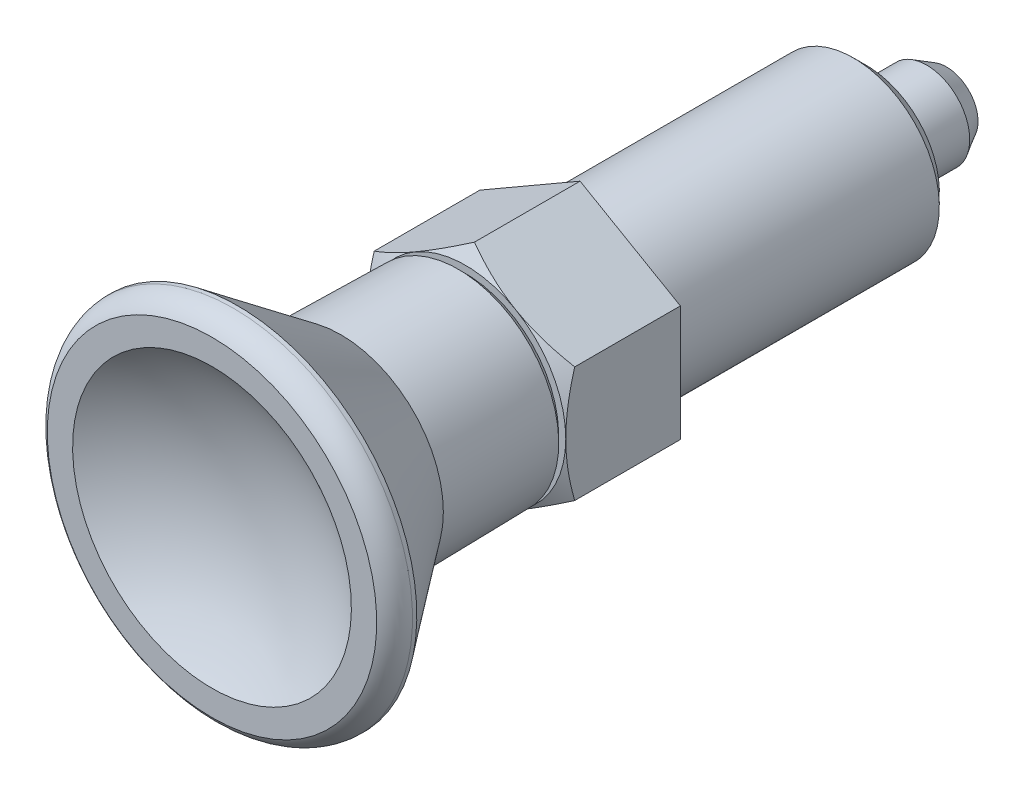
ISO-10303-21;
HEADER;
FILE_DESCRIPTION(('STEP AP214'),'2;1');
FILE_NAME('part.step','',(''),(''),'','','');
FILE_SCHEMA(('AUTOMOTIVE_DESIGN { 1 0 10303 214 1 1 1 1 }'));
ENDSEC;
DATA;
#1=APPLICATION_CONTEXT('core data for automotive mechanical design processes');
#2=APPLICATION_PROTOCOL_DEFINITION('international standard','automotive_design',2000,#1);
#3=PRODUCT_CONTEXT('',#1,'mechanical');
#4=PRODUCT('Part','Part','',(#3));
#5=PRODUCT_RELATED_PRODUCT_CATEGORY('part','',(#4));
#6=PRODUCT_DEFINITION_FORMATION('','',#4);
#7=PRODUCT_DEFINITION_CONTEXT('part definition',#1,'design');
#8=PRODUCT_DEFINITION('design','',#6,#7);
#9=PRODUCT_DEFINITION_SHAPE('','',#8);
#10=(LENGTH_UNIT() NAMED_UNIT(*) SI_UNIT(.MILLI.,.METRE.));
#11=(NAMED_UNIT(*) PLANE_ANGLE_UNIT() SI_UNIT($,.RADIAN.));
#12=(NAMED_UNIT(*) SI_UNIT($,.STERADIAN.) SOLID_ANGLE_UNIT());
#13=UNCERTAINTY_MEASURE_WITH_UNIT(LENGTH_MEASURE(1.E-05),#10,'distance_accuracy_value','');
#14=(GEOMETRIC_REPRESENTATION_CONTEXT(3) GLOBAL_UNCERTAINTY_ASSIGNED_CONTEXT((#13)) GLOBAL_UNIT_ASSIGNED_CONTEXT((#10,
#11,#12)) REPRESENTATION_CONTEXT('',''));
#15=CARTESIAN_POINT('',(0.,0.,0.));
#16=DIRECTION('',(0.,0.,1.));
#17=DIRECTION('',(1.,0.,0.));
#18=AXIS2_PLACEMENT_3D('',#15,#16,#17);
#19=CARTESIAN_POINT('',(0.,0.,-20.));
#20=DIRECTION('',(-1.,0.,0.));
#21=DIRECTION('',(0.,1.,0.));
#22=AXIS2_PLACEMENT_3D('',#19,#20,#21);
#23=SPHERICAL_SURFACE('',#22,6.00000000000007);
#24=CARTESIAN_POINT('',(0.,0.,-25.5810746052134));
#25=DIRECTION('',(0.,0.,1.));
#26=DIRECTION('',(-1.,0.,0.));
#27=AXIS2_PLACEMENT_3D('',#24,#25,#26);
#28=CIRCLE('',#27,2.20263620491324);
#29=CARTESIAN_POINT('',(-2.20263620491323,0.,-25.5810746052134));
#30=VERTEX_POINT('',#29);
#31=EDGE_CURVE('E18',#30,#30,#28,.T.);
#32=ORIENTED_EDGE('',*,*,#31,.F.);
#33=EDGE_LOOP('',(#32));
#34=FACE_BOUND('',#33,.T.);
#35=ADVANCED_FACE('F14',(#34),#23,.T.);
#36=CARTESIAN_POINT('',(0.,0.,-24.2000000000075));
#37=DIRECTION('',(0.,0.,1.));
#38=DIRECTION('',(-1.,0.,0.));
#39=AXIS2_PLACEMENT_3D('',#36,#37,#38);
#40=CONICAL_SURFACE('',#39,2.99999999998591,0.523598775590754);
#41=CARTESIAN_POINT('',(0.,0.,-24.2));
#42=DIRECTION('',(0.,0.,1.));
#43=DIRECTION('',(0.,-1.,0.));
#44=AXIS2_PLACEMENT_3D('',#41,#42,#43);
#45=CIRCLE('',#44,3.);
#46=CARTESIAN_POINT('',(0.,-3.,-24.2));
#47=VERTEX_POINT('',#46);
#48=EDGE_CURVE('E190',#47,#47,#45,.T.);
#49=ORIENTED_EDGE('',*,*,#48,.F.);
#50=EDGE_LOOP('',(#49));
#51=FACE_BOUND('',#50,.T.);
#52=ORIENTED_EDGE('',*,*,#31,.T.);
#53=EDGE_LOOP('',(#52));
#54=FACE_BOUND('',#53,.T.);
#55=ADVANCED_FACE('F297',(#51,#54),#40,.T.);
#56=CARTESIAN_POINT('',(0.,0.,-26.));
#57=DIRECTION('',(0.,0.,1.));
#58=DIRECTION('',(0.,-1.,0.));
#59=AXIS2_PLACEMENT_3D('',#56,#57,#58);
#60=CYLINDRICAL_SURFACE('',#59,3.);
#61=CARTESIAN_POINT('',(0.,0.,-20.5000000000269));
#62=DIRECTION('',(0.,0.,-1.));
#63=DIRECTION('',(0.,1.,0.));
#64=AXIS2_PLACEMENT_3D('',#61,#62,#63);
#65=CIRCLE('',#64,3.00000000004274);
#66=CARTESIAN_POINT('',(0.,3.00000000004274,-20.5000000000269));
#67=VERTEX_POINT('',#66);
#68=EDGE_CURVE('E185',#67,#67,#65,.F.);
#69=ORIENTED_EDGE('',*,*,#68,.F.);
#70=EDGE_LOOP('',(#69));
#71=FACE_BOUND('',#70,.T.);
#72=ORIENTED_EDGE('',*,*,#48,.T.);
#73=EDGE_LOOP('',(#72));
#74=FACE_BOUND('',#73,.T.);
#75=ADVANCED_FACE('F292',(#71,#74),#60,.T.);
#76=CARTESIAN_POINT('',(0.,0.,-20.5000000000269));
#77=DIRECTION('',(0.,0.,-1.));
#78=DIRECTION('',(0.,1.,0.));
#79=AXIS2_PLACEMENT_3D('',#76,#77,#78);
#80=CONICAL_SURFACE('',#79,3.00000000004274,0.523598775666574);
#81=CARTESIAN_POINT('',(0.,0.,-20.3267949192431));
#82=DIRECTION('',(0.,0.,1.));
#83=DIRECTION('',(0.,-1.,0.));
#84=AXIS2_PLACEMENT_3D('',#81,#82,#83);
#85=CIRCLE('',#84,2.9);
#86=CARTESIAN_POINT('',(0.,-2.9,-20.3267949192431));
#87=VERTEX_POINT('',#86);
#88=EDGE_CURVE('E176',#87,#87,#85,.T.);
#89=ORIENTED_EDGE('',*,*,#88,.F.);
#90=EDGE_LOOP('',(#89));
#91=FACE_BOUND('',#90,.T.);
#92=ORIENTED_EDGE('',*,*,#68,.T.);
#93=EDGE_LOOP('',(#92));
#94=FACE_BOUND('',#93,.T.);
#95=ADVANCED_FACE('F287',(#91,#94),#80,.T.);
#96=CARTESIAN_POINT('',(0.,0.,-26.));
#97=DIRECTION('',(0.,0.,1.));
#98=DIRECTION('',(0.,-1.,0.));
#99=AXIS2_PLACEMENT_3D('',#96,#97,#98);
#100=CYLINDRICAL_SURFACE('',#99,2.9);
#101=CARTESIAN_POINT('',(0.,0.,-20.2));
#102=DIRECTION('',(0.,0.,-1.));
#103=DIRECTION('',(0.,1.,0.));
#104=AXIS2_PLACEMENT_3D('',#101,#102,#103);
#105=CIRCLE('',#104,2.9);
#106=CARTESIAN_POINT('',(0.,2.9,-20.2));
#107=VERTEX_POINT('',#106);
#108=EDGE_CURVE('E184',#107,#107,#105,.T.);
#109=ORIENTED_EDGE('',*,*,#108,.T.);
#110=EDGE_LOOP('',(#109));
#111=FACE_BOUND('',#110,.T.);
#112=ORIENTED_EDGE('',*,*,#88,.T.);
#113=EDGE_LOOP('',(#112));
#114=FACE_BOUND('',#113,.T.);
#115=ADVANCED_FACE('F167',(#111,#114),#100,.T.);
#116=CARTESIAN_POINT('',(0.,0.,-20.2));
#117=DIRECTION('',(0.,0.,-1.));
#118=DIRECTION('',(0.,1.,0.));
#119=AXIS2_PLACEMENT_3D('',#116,#117,#118);
#120=TOROIDAL_SURFACE('',#119,3.1,0.2);
#121=CARTESIAN_POINT('',(0.,0.,-20.));
#122=DIRECTION('',(0.,0.,-1.));
#123=DIRECTION('',(0.,1.,0.));
#124=AXIS2_PLACEMENT_3D('',#121,#122,#123);
#125=CIRCLE('',#124,3.1);
#126=CARTESIAN_POINT('',(0.,3.1,-20.));
#127=VERTEX_POINT('',#126);
#128=EDGE_CURVE('E143',#127,#127,#125,.T.);
#129=ORIENTED_EDGE('',*,*,#128,.T.);
#130=EDGE_LOOP('',(#129));
#131=FACE_BOUND('',#130,.T.);
#132=ORIENTED_EDGE('',*,*,#108,.F.);
#133=EDGE_LOOP('',(#132));
#134=FACE_BOUND('',#133,.T.);
#135=ADVANCED_FACE('F161',(#131,#134),#120,.F.);
#136=CARTESIAN_POINT('',(4.07679491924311,0.,-20.));
#137=DIRECTION('',(0.,0.,1.));
#138=DIRECTION('',(0.,-1.,0.));
#139=AXIS2_PLACEMENT_3D('',#136,#137,#138);
#140=PLANE('',#139);
#141=CARTESIAN_POINT('',(0.,0.,-19.9999999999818));
#142=DIRECTION('',(0.,0.,1.));
#143=DIRECTION('',(0.,-1.,0.));
#144=AXIS2_PLACEMENT_3D('',#141,#142,#143);
#145=CIRCLE('',#144,4.07679491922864);
#146=CARTESIAN_POINT('',(0.,-4.07679491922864,-19.9999999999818));
#147=VERTEX_POINT('',#146);
#148=EDGE_CURVE('E136',#147,#147,#145,.T.);
#149=ORIENTED_EDGE('',*,*,#148,.F.);
#150=EDGE_LOOP('',(#149));
#151=FACE_BOUND('',#150,.T.);
#152=ORIENTED_EDGE('',*,*,#128,.F.);
#153=EDGE_LOOP('',(#152));
#154=FACE_BOUND('',#153,.T.);
#155=ADVANCED_FACE('F150',(#151,#154),#140,.F.);
#156=CARTESIAN_POINT('',(0.,0.,-19.6999999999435));
#157=DIRECTION('',(0.,0.,1.));
#158=DIRECTION('',(0.,-1.,0.));
#159=AXIS2_PLACEMENT_3D('',#156,#157,#158);
#160=CONICAL_SURFACE('',#159,4.25000000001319,0.52359877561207);
#161=CARTESIAN_POINT('',(0.,0.,-19.7));
#162=DIRECTION('',(0.,0.,1.));
#163=DIRECTION('',(0.,-1.,0.));
#164=AXIS2_PLACEMENT_3D('',#161,#162,#163);
#165=CIRCLE('',#164,4.25);
#166=CARTESIAN_POINT('',(0.,-4.25,-19.7));
#167=VERTEX_POINT('',#166);
#168=EDGE_CURVE('E132',#167,#167,#165,.F.);
#169=ORIENTED_EDGE('',*,*,#168,.T.);
#170=EDGE_LOOP('',(#169));
#171=FACE_BOUND('',#170,.T.);
#172=ORIENTED_EDGE('',*,*,#148,.T.);
#173=EDGE_LOOP('',(#172));
#174=FACE_BOUND('',#173,.T.);
#175=ADVANCED_FACE('F160',(#171,#174),#160,.T.);
#176=CARTESIAN_POINT('',(0.,0.,-20.));
#177=DIRECTION('',(0.,0.,1.));
#178=DIRECTION('',(0.,-1.,0.));
#179=AXIS2_PLACEMENT_3D('',#176,#177,#178);
#180=CYLINDRICAL_SURFACE('',#179,4.25);
#181=ORIENTED_EDGE('',*,*,#168,.F.);
#182=EDGE_LOOP('',(#181));
#183=FACE_BOUND('',#182,.T.);
#184=CARTESIAN_POINT('',(0.,0.,-20.));
#185=DIRECTION('',(0.,0.,1.));
#186=DIRECTION('',(0.,-1.,0.));
#187=AXIS2_PLACEMENT_3D('',#184,#185,#186);
#188=CIRCLE('',#187,4.25);
#189=CARTESIAN_POINT('',(0.,-4.25,-20.));
#190=VERTEX_POINT('',#189);
#191=EDGE_CURVE('E135',#190,#190,#188,.T.);
#192=ORIENTED_EDGE('',*,*,#191,.F.);
#193=EDGE_LOOP('',(#192));
#194=FACE_BOUND('',#193,.T.);
#195=ADVANCED_FACE('F255',(#183,#194),#180,.F.);
#196=CARTESIAN_POINT('',(4.25,0.,-20.));
#197=DIRECTION('',(0.,0.,-1.));
#198=DIRECTION('',(0.,1.,0.));
#199=AXIS2_PLACEMENT_3D('',#196,#197,#198);
#200=PLANE('',#199);
#201=ORIENTED_EDGE('',*,*,#191,.T.);
#202=EDGE_LOOP('',(#201));
#203=FACE_BOUND('',#202,.T.);
#204=CARTESIAN_POINT('',(0.,0.,-19.9999999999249));
#205=DIRECTION('',(0.,0.,1.));
#206=DIRECTION('',(0.,-1.,0.));
#207=AXIS2_PLACEMENT_3D('',#204,#205,#206);
#208=CIRCLE('',#207,5.08000000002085);
#209=CARTESIAN_POINT('',(0.,-5.08000000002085,-19.9999999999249));
#210=VERTEX_POINT('',#209);
#211=EDGE_CURVE('E129',#210,#210,#208,.T.);
#212=ORIENTED_EDGE('',*,*,#211,.F.);
#213=EDGE_LOOP('',(#212));
#214=FACE_BOUND('',#213,.T.);
#215=ADVANCED_FACE('F246',(#203,#214),#200,.T.);
#216=CARTESIAN_POINT('',(0.,0.,-19.0799999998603));
#217=DIRECTION('',(0.,0.,1.));
#218=DIRECTION('',(0.,-1.,0.));
#219=AXIS2_PLACEMENT_3D('',#216,#217,#218);
#220=CONICAL_SURFACE('',#219,6.00000000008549,0.785398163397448);
#221=ORIENTED_EDGE('',*,*,#211,.T.);
#222=EDGE_LOOP('',(#221));
#223=FACE_BOUND('',#222,.T.);
#224=CARTESIAN_POINT('',(0.,0.,-19.08));
#225=DIRECTION('',(0.,0.,1.));
#226=DIRECTION('',(0.,-1.,0.));
#227=AXIS2_PLACEMENT_3D('',#224,#225,#226);
#228=CIRCLE('',#227,6.);
#229=CARTESIAN_POINT('',(0.,-6.,-19.08));
#230=VERTEX_POINT('',#229);
#231=EDGE_CURVE('E126',#230,#230,#228,.T.);
#232=ORIENTED_EDGE('',*,*,#231,.F.);
#233=EDGE_LOOP('',(#232));
#234=FACE_BOUND('',#233,.T.);
#235=ADVANCED_FACE('F244',(#223,#234),#220,.T.);
#236=CARTESIAN_POINT('',(0.,0.,38.4));
#237=DIRECTION('',(-1.,0.,0.));
#238=DIRECTION('',(0.,1.,0.));
#239=AXIS2_PLACEMENT_3D('',#236,#237,#238);
#240=SPHERICAL_SURFACE('',#239,16.);
#241=CARTESIAN_POINT('',(0.,9.73190628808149,25.7));
#242=CARTESIAN_POINT('',(-0.273421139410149,9.73190824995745,25.7));
#243=CARTESIAN_POINT('',(-0.54681008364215,9.72037876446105,25.7));
#244=CARTESIAN_POINT('',(-1.091736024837,9.67434130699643,25.7));
#245=CARTESIAN_POINT('',(-1.36327251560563,9.63982728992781,25.7));
#246=CARTESIAN_POINT('',(-1.90275798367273,9.54800856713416,25.7));
#247=CARTESIAN_POINT('',(-2.17070282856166,9.49067960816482,25.7));
#248=CARTESIAN_POINT('',(-2.70081243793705,9.35363887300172,25.7));
#249=CARTESIAN_POINT('',(-2.96297710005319,9.27392670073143,25.7));
#250=CARTESIAN_POINT('',(-3.47952585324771,9.09273210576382,25.7));
#251=CARTESIAN_POINT('',(-3.7339137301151,8.99126047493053,25.7));
#252=CARTESIAN_POINT('',(-4.23323988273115,8.76724349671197,25.7));
#253=CARTESIAN_POINT('',(-4.47817800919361,8.64469781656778,25.7));
#254=CARTESIAN_POINT('',(-4.95679945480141,8.37943799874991,25.7));
#255=CARTESIAN_POINT('',(-5.19048552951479,8.23672883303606,25.7));
#256=CARTESIAN_POINT('',(-5.64500156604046,7.93213690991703,25.7));
#257=CARTESIAN_POINT('',(-5.86583180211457,7.77025456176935,25.7));
#258=CARTESIAN_POINT('',(-6.2930965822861,7.42844474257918,25.7));
#259=CARTESIAN_POINT('',(-6.49952946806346,7.24851519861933,25.7));
#260=CARTESIAN_POINT('',(-6.89650428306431,6.87190546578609,25.7));
#261=CARTESIAN_POINT('',(-7.0870461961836,6.67522525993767,25.7));
#262=CARTESIAN_POINT('',(-7.45089134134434,6.26650461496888,25.7));
#263=CARTESIAN_POINT('',(-7.62419390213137,6.05446357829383,25.7));
#264=CARTESIAN_POINT('',(-7.95231974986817,5.61653562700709,25.7));
#265=CARTESIAN_POINT('',(-8.10714304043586,5.39064871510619,25.7));
#266=CARTESIAN_POINT('',(-8.39720695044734,4.92663927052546,25.7));
#267=CARTESIAN_POINT('',(-8.53244793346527,4.68851696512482,25.7));
#268=CARTESIAN_POINT('',(-8.78238916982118,4.2017257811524,25.7));
#269=CARTESIAN_POINT('',(-8.89708942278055,3.95305690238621,25.7));
#270=CARTESIAN_POINT('',(-9.1051335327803,3.44694097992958,25.7));
#271=CARTESIAN_POINT('',(-9.19847743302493,3.18949395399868,25.7));
#272=CARTESIAN_POINT('',(-9.36314551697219,2.66765155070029,25.7));
#273=CARTESIAN_POINT('',(-9.4344697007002,2.40325617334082,25.7));
#274=CARTESIAN_POINT('',(-9.55459139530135,1.86939624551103,25.7));
#275=CARTESIAN_POINT('',(-9.60338886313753,1.59993168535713,25.7));
#276=CARTESIAN_POINT('',(-9.67811000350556,1.05784961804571,25.7));
#277=CARTESIAN_POINT('',(-9.70403367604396,0.785232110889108,25.7));
#278=CARTESIAN_POINT('',(-9.73282289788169,0.238782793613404,25.7));
#279=CARTESIAN_POINT('',(-9.73568848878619,-0.0350490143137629,25.7));
#280=CARTESIAN_POINT('',(-9.7183412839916,-0.581980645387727,25.7));
#281=CARTESIAN_POINT('',(-9.69812848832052,-0.855080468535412,25.7));
#282=CARTESIAN_POINT('',(-9.63476819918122,-1.39860665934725,25.7));
#283=CARTESIAN_POINT('',(-9.59162069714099,-1.66903302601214,25.7));
#284=CARTESIAN_POINT('',(-9.48269774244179,-2.20528963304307,25.7));
#285=CARTESIAN_POINT('',(-9.41692228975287,-2.47111987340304,25.7));
#286=CARTESIAN_POINT('',(-9.26321097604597,-2.99629461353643,25.7));
#287=CARTESIAN_POINT('',(-9.17527509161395,-3.2556391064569,25.7));
#288=CARTESIAN_POINT('',(-8.97786812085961,-3.76599827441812,25.7));
#289=CARTESIAN_POINT('',(-8.86839703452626,-4.0170129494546,25.7));
#290=CARTESIAN_POINT('',(-8.62869797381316,-4.5089278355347,25.7));
#291=CARTESIAN_POINT('',(-8.49847000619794,-4.74982804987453,25.7));
#292=CARTESIAN_POINT('',(-8.21818300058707,-5.21980144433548,25.7));
#293=CARTESIAN_POINT('',(-8.06812396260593,-5.44887462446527,25.7));
#294=CARTESIAN_POINT('',(-7.74924171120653,-5.8935652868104,25.7));
#295=CARTESIAN_POINT('',(-7.580418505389,-6.10918277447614,25.7));
#296=CARTESIAN_POINT('',(-7.22520810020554,-6.52542924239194,25.7));
#297=CARTESIAN_POINT('',(-7.03882090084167,-6.72605822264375,25.7));
#298=CARTESIAN_POINT('',(-6.64980758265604,-7.1109013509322,25.7));
#299=CARTESIAN_POINT('',(-6.44718146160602,-7.29511549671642,25.7));
#300=CARTESIAN_POINT('',(-6.02713087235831,-7.64581927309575,25.7));
#301=CARTESIAN_POINT('',(-5.80970640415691,-7.81230890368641,25.7));
#302=CARTESIAN_POINT('',(-5.36160484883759,-8.12638002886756,25.7));
#303=CARTESIAN_POINT('',(-5.13092775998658,-8.27396152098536,25.7));
#304=CARTESIAN_POINT('',(-4.65796096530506,-8.54916712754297,25.7));
#305=CARTESIAN_POINT('',(-4.41567125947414,-8.67679124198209,25.7));
#306=CARTESIAN_POINT('',(-3.9212017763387,-8.91117475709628,25.7));
#307=CARTESIAN_POINT('',(-3.66902199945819,-9.01793415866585,25.7));
#308=CARTESIAN_POINT('',(-3.15656521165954,-9.2098292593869,25.7));
#309=CARTESIAN_POINT('',(-2.89628820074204,-9.29496495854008,25.7));
#310=CARTESIAN_POINT('',(-2.36948737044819,-9.44300738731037,25.7));
#311=CARTESIAN_POINT('',(-2.10296355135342,-9.50591411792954,25.7));
#312=CARTESIAN_POINT('',(-1.56556391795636,-9.60905138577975,25.7));
#313=CARTESIAN_POINT('',(-1.29468810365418,-9.6492819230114,25.7));
#314=CARTESIAN_POINT('',(-0.750510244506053,-9.70678078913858,25.7));
#315=CARTESIAN_POINT('',(-0.47720819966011,-9.72404911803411,25.7));
#316=CARTESIAN_POINT('',(0.0698791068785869,-9.7355007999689,25.7));
#317=CARTESIAN_POINT('',(0.343664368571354,-9.72968415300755,25.7));
#318=CARTESIAN_POINT('',(0.889771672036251,-9.69500723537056,25.7));
#319=CARTESIAN_POINT('',(1.16209371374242,-9.66614696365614,25.7));
#320=CARTESIAN_POINT('',(1.70333851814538,-9.58558797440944,25.7));
#321=CARTESIAN_POINT('',(1.97226128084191,-9.53388925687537,25.7));
#322=CARTESIAN_POINT('',(2.50479565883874,-9.40802092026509,25.7));
#323=CARTESIAN_POINT('',(2.76840727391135,-9.33385130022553,25.7));
#324=CARTESIAN_POINT('',(3.28844522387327,-9.16356846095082,25.7));
#325=CARTESIAN_POINT('',(3.54487155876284,-9.06745524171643,25.7));
#326=CARTESIAN_POINT('',(4.04871587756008,-8.85396852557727,25.7));
#327=CARTESIAN_POINT('',(4.29613386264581,-8.73659503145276,25.7));
#328=CARTESIAN_POINT('',(4.78020252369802,-8.48142221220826,25.7));
#329=CARTESIAN_POINT('',(5.0168531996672,-8.34362288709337,25.7));
#330=CARTESIAN_POINT('',(5.47770476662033,-8.04857809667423,25.7));
#331=CARTESIAN_POINT('',(5.70190565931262,-7.89133263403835,25.7));
#332=CARTESIAN_POINT('',(6.13626376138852,-7.55851347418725,25.7));
#333=CARTESIAN_POINT('',(6.34642097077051,-7.3829397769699,25.7));
#334=CARTESIAN_POINT('',(6.75119769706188,-7.01471229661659,25.7));
#335=CARTESIAN_POINT('',(6.94581720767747,-6.82205850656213,25.7));
#336=CARTESIAN_POINT('',(7.31813481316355,-6.42104055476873,25.7));
#337=CARTESIAN_POINT('',(7.49583290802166,-6.2126763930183,25.7));
#338=CARTESIAN_POINT('',(7.83304440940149,-5.78171897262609,25.7));
#339=CARTESIAN_POINT('',(7.99255780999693,-5.55912570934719,25.7));
#340=CARTESIAN_POINT('',(8.29226580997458,-5.10129265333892,25.7));
#341=CARTESIAN_POINT('',(8.43246040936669,-4.86605286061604,25.7));
#342=CARTESIAN_POINT('',(8.69253396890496,-4.38459941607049,25.7));
#343=CARTESIAN_POINT('',(8.8124129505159,-4.13838577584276,25.7));
#344=CARTESIAN_POINT('',(9.03100318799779,-3.63673483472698,25.7));
#345=CARTESIAN_POINT('',(9.12971444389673,-3.38129753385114,25.7));
#346=CARTESIAN_POINT('',(9.30526742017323,-2.86301537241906,25.7));
#347=CARTESIAN_POINT('',(9.38210914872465,-2.60017051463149,25.7));
#348=CARTESIAN_POINT('',(9.51337682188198,-2.06894181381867,25.7));
#349=CARTESIAN_POINT('',(9.56780276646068,-1.8005579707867,25.7));
#350=CARTESIAN_POINT('',(9.65385201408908,-1.26015885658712,25.7));
#351=CARTESIAN_POINT('',(9.68547527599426,-0.988143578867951,25.7));
#352=CARTESIAN_POINT('',(9.72569417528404,-0.442415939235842,25.7));
#353=CARTESIAN_POINT('',(9.73428981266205,-0.168703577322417,25.7));
#354=CARTESIAN_POINT('',(9.72839235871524,0.378471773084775,25.7));
#355=CARTESIAN_POINT('',(9.71389931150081,0.651934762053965,25.7));
#356=CARTESIAN_POINT('',(9.66192760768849,1.19666773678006,25.7));
#357=CARTESIAN_POINT('',(9.6244489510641,1.46793772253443,25.7));
#358=CARTESIAN_POINT('',(9.52677237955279,2.00635667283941,25.7));
#359=CARTESIAN_POINT('',(9.46657441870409,2.27350562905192,25.7));
#360=CARTESIAN_POINT('',(9.32388721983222,2.80178267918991,25.7));
#361=CARTESIAN_POINT('',(9.24139798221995,3.06291077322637,25.7));
#362=CARTESIAN_POINT('',(9.05471294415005,3.57729441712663,25.7));
#363=CARTESIAN_POINT('',(8.95051674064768,3.83054982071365,25.7));
#364=CARTESIAN_POINT('',(8.72115947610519,4.3273824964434,25.7));
#365=CARTESIAN_POINT('',(8.59599841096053,4.5709597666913,25.7));
#366=CARTESIAN_POINT('',(8.32560656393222,5.04669509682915,25.7));
#367=CARTESIAN_POINT('',(8.18037656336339,5.27885360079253,25.7));
#368=CARTESIAN_POINT('',(7.87087575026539,5.73011089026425,25.7));
#369=CARTESIAN_POINT('',(7.70660495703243,5.94920968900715,25.7));
#370=CARTESIAN_POINT('',(7.36021019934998,6.37276584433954,25.7));
#371=CARTESIAN_POINT('',(7.17808828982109,6.57722488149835,25.7));
#372=CARTESIAN_POINT('',(6.79726585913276,6.97008025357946,25.7));
#373=CARTESIAN_POINT('',(6.59856498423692,7.15847624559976,25.7));
#374=CARTESIAN_POINT('',(6.18594941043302,7.51790585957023,25.7));
#375=CARTESIAN_POINT('',(5.97203097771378,7.6889351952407,25.7));
#376=CARTESIAN_POINT('',(5.53054854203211,8.01235979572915,25.7));
#377=CARTESIAN_POINT('',(5.30298475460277,8.16475535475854,25.7));
#378=CARTESIAN_POINT('',(4.83571056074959,8.44990255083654,25.7));
#379=CARTESIAN_POINT('',(4.59599419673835,8.58264442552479,25.7));
#380=CARTESIAN_POINT('',(4.1062308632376,8.82744687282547,25.7));
#381=CARTESIAN_POINT('',(3.85618407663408,8.93950781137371,25.7));
#382=CARTESIAN_POINT('',(3.34780095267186,9.14204631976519,25.7));
#383=CARTESIAN_POINT('',(3.08947372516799,9.23254674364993,25.7));
#384=CARTESIAN_POINT('',(2.56620241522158,9.39145195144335,25.7));
#385=CARTESIAN_POINT('',(2.30126009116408,9.45986254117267,25.7));
#386=CARTESIAN_POINT('',(1.69995282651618,9.5883632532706,25.7));
#387=CARTESIAN_POINT('',(1.36222155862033,9.6421462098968,25.7));
#388=CARTESIAN_POINT('',(0.68297678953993,9.71391650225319,25.7));
#389=CARTESIAN_POINT('',(0.341463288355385,9.73190383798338,25.7));
#390=CARTESIAN_POINT('',(0.,9.73190628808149,25.7));
#391=B_SPLINE_CURVE_WITH_KNOTS('',3,(#241,#242,#243,#244,#245,#246,#247,#248,#249,#250,#251,
#252,#253,#254,#255,#256,#257,#258,#259,#260,#261,#262,#263,#264,#265,#266,#267,#268,#269,#270,
#271,#272,#273,#274,#275,#276,#277,#278,#279,#280,#281,#282,#283,#284,#285,#286,#287,#288,#289,
#290,#291,#292,#293,#294,#295,#296,#297,#298,#299,#300,#301,#302,#303,#304,#305,#306,#307,#308,
#309,#310,#311,#312,#313,#314,#315,#316,#317,#318,#319,#320,#321,#322,#323,#324,#325,#326,#327,
#328,#329,#330,#331,#332,#333,#334,#335,#336,#337,#338,#339,#340,#341,#342,#343,#344,#345,#346,
#347,#348,#349,#350,#351,#352,#353,#354,#355,#356,#357,#358,#359,#360,#361,#362,#363,#364,#365,
#366,#367,#368,#369,#370,#371,#372,#373,#374,#375,#376,#377,#378,#379,#380,#381,#382,#383,#384,
#385,#386,#387,#388,#389,#390),.UNSPECIFIED.,.T.,.F.,(4,2,2,2,2,2,2,2,2,2,2,2,2,2,2,2,2,2,2,2,2,
2,2,2,2,2,2,2,2,2,2,2,2,2,2,2,2,2,2,2,2,2,2,2,2,2,2,2,2,2,2,2,2,2,2,2,2,2,2,2,2,2,2,2,2,2,2,2,2,
2,2,2,2,2,4),(0.,0.819965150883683,1.64014604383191,2.46120116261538,3.28227081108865,
4.10293417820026,4.9236105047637,5.74408481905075,6.56454162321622,7.38509277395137,
8.20564475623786,9.02622867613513,9.84681243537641,10.6673809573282,11.4879494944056,
12.3085163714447,13.1290832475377,13.9496516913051,14.7702201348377,15.5907870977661,
16.411354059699,17.2319213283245,18.0524885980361,18.8730567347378,19.6936248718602,
20.5141927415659,21.3347606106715,22.1553281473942,22.9758956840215,23.7964633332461,
24.6170309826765,25.4375987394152,26.2581664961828,27.0787342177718,27.8993019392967,
28.7198696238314,29.5404373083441,30.3610049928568,31.1815726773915,32.0021403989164,
32.8227081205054,33.6432758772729,34.4638436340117,35.284411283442,36.1049789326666,
36.9255464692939,37.7461140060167,38.5666818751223,39.3872497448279,40.2078178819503,
41.028386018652,41.8489532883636,42.6695205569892,43.4900875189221,44.3106544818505,
45.1312229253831,45.9517913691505,46.7723582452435,47.5929251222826,48.41349365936,
49.2340621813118,50.054645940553,50.8752298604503,51.6957818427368,52.5163329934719,
53.3367897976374,54.1572641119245,54.9779404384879,55.7986038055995,56.6196734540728,
57.4407285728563,58.2609094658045,59.0808746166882,60.1048919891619,61.1289093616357),.UNSPECIFIED.);
#392=CARTESIAN_POINT('',(0.,9.73190628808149,25.7));
#393=VERTEX_POINT('',#392);
#394=EDGE_CURVE('E205',#393,#393,#391,.T.);
#395=ORIENTED_EDGE('',*,*,#394,.T.);
#396=EDGE_LOOP('',(#395));
#397=FACE_BOUND('',#396,.T.);
#398=ADVANCED_FACE('F215',(#397),#240,.F.);
#399=CARTESIAN_POINT('',(9.73190628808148,0.,25.7));
#400=DIRECTION('',(0.,0.,-1.));
#401=DIRECTION('',(0.,1.,0.));
#402=AXIS2_PLACEMENT_3D('',#399,#400,#401);
#403=PLANE('',#402);
#404=ORIENTED_EDGE('',*,*,#394,.F.);
#405=EDGE_LOOP('',(#404));
#406=FACE_BOUND('',#405,.T.);
#407=CARTESIAN_POINT('',(0.,0.,25.7));
#408=DIRECTION('',(0.,0.,-1.));
#409=DIRECTION('',(0.,1.,0.));
#410=AXIS2_PLACEMENT_3D('',#407,#408,#409);
#411=CIRCLE('',#410,11.5);
#412=CARTESIAN_POINT('',(0.,11.5,25.7));
#413=VERTEX_POINT('',#412);
#414=EDGE_CURVE('E198',#413,#413,#411,.T.);
#415=ORIENTED_EDGE('',*,*,#414,.F.);
#416=EDGE_LOOP('',(#415));
#417=FACE_BOUND('',#416,.T.);
#418=ADVANCED_FACE('F220',(#406,#417),#403,.F.);
#419=CARTESIAN_POINT('',(0.,0.,23.9596620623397));
#420=DIRECTION('',(0.,0.,-1.));
#421=DIRECTION('',(0.,1.,0.));
#422=AXIS2_PLACEMENT_3D('',#419,#420,#421);
#423=TOROIDAL_SURFACE('',#422,10.5144930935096,2.);
#424=CARTESIAN_POINT('',(0.,0.,24.2));
#425=DIRECTION('',(0.,0.,1.));
#426=DIRECTION('',(0.,-1.,0.));
#427=AXIS2_PLACEMENT_3D('',#424,#425,#426);
#428=CIRCLE('',#427,12.5);
#429=CARTESIAN_POINT('',(0.,-12.5,24.2));
#430=VERTEX_POINT('',#429);
#431=EDGE_CURVE('E662',#430,#430,#428,.F.);
#432=ORIENTED_EDGE('',*,*,#431,.F.);
#433=EDGE_LOOP('',(#432));
#434=FACE_BOUND('',#433,.T.);
#435=ORIENTED_EDGE('',*,*,#414,.T.);
#436=EDGE_LOOP('',(#435));
#437=FACE_BOUND('',#436,.T.);
#438=ADVANCED_FACE('F224',(#434,#437),#423,.T.);
#439=CARTESIAN_POINT('',(0.,0.,-26.));
#440=DIRECTION('',(0.,0.,1.));
#441=DIRECTION('',(0.,-1.,0.));
#442=AXIS2_PLACEMENT_3D('',#439,#440,#441);
#443=CYLINDRICAL_SURFACE('',#442,12.5);
#444=ORIENTED_EDGE('',*,*,#431,.T.);
#445=EDGE_LOOP('',(#444));
#446=FACE_BOUND('',#445,.T.);
#447=CARTESIAN_POINT('',(0.,0.,23.9));
#448=DIRECTION('',(0.,0.,1.));
#449=DIRECTION('',(0.,-1.,0.));
#450=AXIS2_PLACEMENT_3D('',#447,#448,#449);
#451=CIRCLE('',#450,12.5);
#452=CARTESIAN_POINT('',(0.,-12.5,23.9));
#453=VERTEX_POINT('',#452);
#454=EDGE_CURVE('E9',#453,#453,#451,.F.);
#455=ORIENTED_EDGE('',*,*,#454,.F.);
#456=EDGE_LOOP('',(#455));
#457=FACE_BOUND('',#456,.T.);
#458=ADVANCED_FACE('F403',(#446,#457),#443,.T.);
#459=CARTESIAN_POINT('',(0.,0.,23.9));
#460=DIRECTION('',(0.,0.,1.));
#461=DIRECTION('',(0.,-1.,0.));
#462=AXIS2_PLACEMENT_3D('',#459,#460,#461);
#463=CONICAL_SURFACE('',#462,12.5,0.638790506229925);
#464=ORIENTED_EDGE('',*,*,#454,.T.);
#465=EDGE_LOOP('',(#464));
#466=FACE_BOUND('',#465,.T.);
#467=CARTESIAN_POINT('',(0.,0.,16.6986913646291));
#468=DIRECTION('',(0.,0.,1.));
#469=DIRECTION('',(0.,-1.,0.));
#470=AXIS2_PLACEMENT_3D('',#467,#468,#469);
#471=CIRCLE('',#470,7.15183622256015);
#472=CARTESIAN_POINT('',(0.,-7.15183622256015,16.6986913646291));
#473=VERTEX_POINT('',#472);
#474=EDGE_CURVE('E24',#473,#473,#471,.T.);
#475=ORIENTED_EDGE('',*,*,#474,.T.);
#476=EDGE_LOOP('',(#475));
#477=FACE_BOUND('',#476,.T.);
#478=ADVANCED_FACE('F410',(#466,#477),#463,.T.);
#479=CARTESIAN_POINT('',(0.,0.,16.6986913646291));
#480=DIRECTION('',(0.,0.,1.));
#481=DIRECTION('',(0.,-1.,0.));
#482=AXIS2_PLACEMENT_3D('',#479,#480,#481);
#483=CONICAL_SURFACE('',#482,7.15183622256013,0.0174532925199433);
#484=ORIENTED_EDGE('',*,*,#474,.F.);
#485=EDGE_LOOP('',(#484));
#486=FACE_BOUND('',#485,.T.);
#487=CARTESIAN_POINT('',(0.,0.,8.4999238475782));
#488=DIRECTION('',(0.,0.,1.));
#489=DIRECTION('',(0.,-1.,0.));
#490=AXIS2_PLACEMENT_3D('',#487,#488,#489);
#491=CIRCLE('',#490,7.00872620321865);
#492=CARTESIAN_POINT('',(0.,-7.00872620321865,8.49992384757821));
#493=VERTEX_POINT('',#492);
#494=EDGE_CURVE('E201',#493,#493,#491,.T.);
#495=ORIENTED_EDGE('',*,*,#494,.T.);
#496=EDGE_LOOP('',(#495));
#497=FACE_BOUND('',#496,.T.);
#498=ADVANCED_FACE('F240',(#486,#497),#483,.T.);
#499=CARTESIAN_POINT('',(0.,0.,8.4999238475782));
#500=DIRECTION('',(0.,0.,1.));
#501=DIRECTION('',(0.,-1.,0.));
#502=AXIS2_PLACEMENT_3D('',#499,#500,#501);
#503=CONICAL_SURFACE('',#502,7.00872620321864,0.794124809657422);
#504=ORIENTED_EDGE('',*,*,#494,.F.);
#505=EDGE_LOOP('',(#504));
#506=FACE_BOUND('',#505,.T.);
#507=CARTESIAN_POINT('',(0.,0.,8.));
#508=DIRECTION('',(0.,0.,1.));
#509=DIRECTION('',(0.,-1.,0.));
#510=AXIS2_PLACEMENT_3D('',#507,#508,#509);
#511=CIRCLE('',#510,6.5);
#512=CARTESIAN_POINT('',(0.,-6.5,8.));
#513=VERTEX_POINT('',#512);
#514=EDGE_CURVE('E202',#513,#513,#511,.T.);
#515=ORIENTED_EDGE('',*,*,#514,.T.);
#516=EDGE_LOOP('',(#515));
#517=FACE_BOUND('',#516,.T.);
#518=ADVANCED_FACE('F226',(#506,#517),#503,.T.);
#519=CARTESIAN_POINT('',(7.,0.,8.));
#520=DIRECTION('',(0.,0.,1.));
#521=DIRECTION('',(0.,-1.,0.));
#522=AXIS2_PLACEMENT_3D('',#519,#520,#521);
#523=PLANE('',#522);
#524=CARTESIAN_POINT('',(0.,0.,8.));
#525=DIRECTION('',(0.,0.,-1.));
#526=DIRECTION('',(0.,1.,0.));
#527=AXIS2_PLACEMENT_3D('',#524,#525,#526);
#528=CIRCLE('',#527,7.);
#529=CARTESIAN_POINT('',(-7.,0.,8.));
#530=VERTEX_POINT('',#529);
#531=CARTESIAN_POINT('',(-3.5,-6.06217782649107,8.));
#532=VERTEX_POINT('',#531);
#533=EDGE_CURVE('E690',#530,#532,#528,.F.);
#534=ORIENTED_EDGE('',*,*,#533,.T.);
#535=CARTESIAN_POINT('',(0.,0.,8.));
#536=DIRECTION('',(0.,0.,-1.));
#537=DIRECTION('',(0.,1.,0.));
#538=AXIS2_PLACEMENT_3D('',#535,#536,#537);
#539=CIRCLE('',#538,7.);
#540=CARTESIAN_POINT('',(3.5,-6.06217782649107,8.));
#541=VERTEX_POINT('',#540);
#542=EDGE_CURVE('E213',#532,#541,#539,.F.);
#543=ORIENTED_EDGE('',*,*,#542,.T.);
#544=CARTESIAN_POINT('',(0.,0.,8.));
#545=DIRECTION('',(0.,0.,-1.));
#546=DIRECTION('',(0.,1.,0.));
#547=AXIS2_PLACEMENT_3D('',#544,#545,#546);
#548=CIRCLE('',#547,7.);
#549=CARTESIAN_POINT('',(7.,0.,8.));
#550=VERTEX_POINT('',#549);
#551=EDGE_CURVE('E647',#541,#550,#548,.F.);
#552=ORIENTED_EDGE('',*,*,#551,.T.);
#553=CARTESIAN_POINT('',(0.,0.,8.));
#554=DIRECTION('',(0.,0.,-1.));
#555=DIRECTION('',(0.,1.,0.));
#556=AXIS2_PLACEMENT_3D('',#553,#554,#555);
#557=CIRCLE('',#556,7.);
#558=CARTESIAN_POINT('',(3.5,6.06217782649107,8.));
#559=VERTEX_POINT('',#558);
#560=EDGE_CURVE('E700',#550,#559,#557,.F.);
#561=ORIENTED_EDGE('',*,*,#560,.T.);
#562=CARTESIAN_POINT('',(0.,0.,8.));
#563=DIRECTION('',(0.,0.,-1.));
#564=DIRECTION('',(0.,1.,0.));
#565=AXIS2_PLACEMENT_3D('',#562,#563,#564);
#566=CIRCLE('',#565,7.);
#567=CARTESIAN_POINT('',(-3.5,6.06217782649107,8.));
#568=VERTEX_POINT('',#567);
#569=EDGE_CURVE('E698',#559,#568,#566,.F.);
#570=ORIENTED_EDGE('',*,*,#569,.T.);
#571=CARTESIAN_POINT('',(0.,0.,8.));
#572=DIRECTION('',(0.,0.,-1.));
#573=DIRECTION('',(0.,1.,0.));
#574=AXIS2_PLACEMENT_3D('',#571,#572,#573);
#575=CIRCLE('',#574,7.);
#576=EDGE_CURVE('E694',#568,#530,#575,.F.);
#577=ORIENTED_EDGE('',*,*,#576,.T.);
#578=EDGE_LOOP('',(#534,#543,#552,#561,#570,#577));
#579=FACE_BOUND('',#578,.T.);
#580=ORIENTED_EDGE('',*,*,#514,.F.);
#581=EDGE_LOOP('',(#580));
#582=FACE_BOUND('',#581,.T.);
#583=ADVANCED_FACE('F228',(#579,#582),#523,.T.);
#584=CARTESIAN_POINT('',(0.,0.,7.37103392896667));
#585=DIRECTION('',(0.,0.,-1.));
#586=DIRECTION('',(0.,1.,0.));
#587=AXIS2_PLACEMENT_3D('',#584,#585,#586);
#588=CONICAL_SURFACE('',#587,8.08940119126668,1.0471975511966);
#589=ORIENTED_EDGE('',*,*,#542,.F.);
#590=CARTESIAN_POINT('',(-3.5,-6.06217782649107,8.));
#591=CARTESIAN_POINT('',(-3.35144463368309,-6.1479463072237,8.00002860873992));
#592=CARTESIAN_POINT('',(-3.20289642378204,-6.23371065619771,7.99636029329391));
#593=CARTESIAN_POINT('',(-2.90609168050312,-6.40507095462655,7.98184244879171));
#594=CARTESIAN_POINT('',(-2.75783509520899,-6.49066693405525,7.9709943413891));
#595=CARTESIAN_POINT('',(-2.46257122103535,-6.66113761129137,7.94240098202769));
#596=CARTESIAN_POINT('',(-2.31556139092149,-6.74601377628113,7.92469045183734));
#597=CARTESIAN_POINT('',(-2.02224213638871,-6.91536172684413,7.88275320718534));
#598=CARTESIAN_POINT('',(-1.87593273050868,-6.99983350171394,7.85852632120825));
#599=CARTESIAN_POINT('',(-1.43866161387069,-7.25229209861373,7.77681956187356));
#600=CARTESIAN_POINT('',(-1.14897019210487,-7.41954551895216,7.71027391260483));
#601=CARTESIAN_POINT('',(-0.572078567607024,-7.75261405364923,7.5568026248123));
#602=CARTESIAN_POINT('',(-0.28489848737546,-7.91841755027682,7.46977520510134));
#603=CARTESIAN_POINT('',(2.31894375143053E-08,-8.08290378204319,7.37478520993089));
#604=B_SPLINE_CURVE_WITH_KNOTS('',3,(#590,#591,#592,#593,#594,#595,#596,#597,#598,#599,#600,
#601,#602,#603),.UNSPECIFIED.,.F.,.F.,(4,2,2,2,2,2,4),(0.,0.514558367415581,1.02901487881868,
1.54090168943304,2.05280197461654,3.07526086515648,4.10291219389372),.UNSPECIFIED.);
#605=CARTESIAN_POINT('',(3.75145026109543E-08,-8.08290374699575,7.37478523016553));
#606=VERTEX_POINT('',#605);
#607=EDGE_CURVE('E33',#532,#606,#604,.T.);
#608=ORIENTED_EDGE('',*,*,#607,.T.);
#609=CARTESIAN_POINT('',(7.50290026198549E-08,-8.08290372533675,7.37478524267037));
#610=CARTESIAN_POINT('',(0.284898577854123,-7.91841749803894,7.46977523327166));
#611=CARTESIAN_POINT('',(0.572078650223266,-7.75261400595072,7.55680264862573));
#612=CARTESIAN_POINT('',(1.14897025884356,-7.41954548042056,7.71027392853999));
#613=CARTESIAN_POINT('',(1.43866167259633,-7.25229206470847,7.77681957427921));
#614=CARTESIAN_POINT('',(1.8759327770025,-6.99983347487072,7.85852632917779));
#615=CARTESIAN_POINT('',(2.02224217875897,-6.91536170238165,7.88275321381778));
#616=CARTESIAN_POINT('',(2.31556142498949,-6.74601375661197,7.9246904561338));
#617=CARTESIAN_POINT('',(2.46257125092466,-6.66113759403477,7.94240098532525));
#618=CARTESIAN_POINT('',(2.75783511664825,-6.49066692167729,7.97099434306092));
#619=CARTESIAN_POINT('',(2.9060916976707,-6.40507094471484,7.98184244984));
#620=CARTESIAN_POINT('',(3.20289643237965,-6.23371065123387,7.99636029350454));
#621=CARTESIAN_POINT('',(3.3514446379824,-6.14794630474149,8.00002860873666));
#622=CARTESIAN_POINT('',(3.5,-6.06217782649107,8.));
#623=B_SPLINE_CURVE_WITH_KNOTS('',3,(#609,#610,#611,#612,#613,#614,#615,#616,#617,#618,#619,
#620,#621,#622),.UNSPECIFIED.,.F.,.F.,(4,2,2,2,2,2,4),(0.,1.02765129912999,2.05011016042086,
2.56201043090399,3.07389722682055,3.58835372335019,4.10291207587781),.UNSPECIFIED.);
#624=EDGE_CURVE('E585',#606,#541,#623,.T.);
#625=ORIENTED_EDGE('',*,*,#624,.T.);
#626=EDGE_LOOP('',(#589,#608,#625));
#627=FACE_BOUND('',#626,.T.);
#628=ADVANCED_FACE('F230',(#627),#588,.T.);
#629=CARTESIAN_POINT('',(0.,0.,7.37103392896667));
#630=DIRECTION('',(0.,0.,-1.));
#631=DIRECTION('',(0.,1.,0.));
#632=AXIS2_PLACEMENT_3D('',#629,#630,#631);
#633=CONICAL_SURFACE('',#632,8.08940119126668,1.0471975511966);
#634=ORIENTED_EDGE('',*,*,#551,.F.);
#635=CARTESIAN_POINT('',(3.5,-6.06217782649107,8.));
#636=CARTESIAN_POINT('',(3.64855536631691,-5.97640934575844,8.00002860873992));
#637=CARTESIAN_POINT('',(3.79710357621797,-5.89064499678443,7.99636029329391));
#638=CARTESIAN_POINT('',(4.0939083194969,-5.71928469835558,7.98184244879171));
#639=CARTESIAN_POINT('',(4.24216490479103,-5.63368871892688,7.9709943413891));
#640=CARTESIAN_POINT('',(4.53742877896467,-5.46321804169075,7.94240098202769));
#641=CARTESIAN_POINT('',(4.68443860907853,-5.37834187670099,7.92469045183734));
#642=CARTESIAN_POINT('',(4.97775786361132,-5.20899392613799,7.88275320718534));
#643=CARTESIAN_POINT('',(5.12406726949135,-5.12452215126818,7.85852632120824));
#644=CARTESIAN_POINT('',(5.56133838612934,-4.87206355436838,7.77681956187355));
#645=CARTESIAN_POINT('',(5.85102980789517,-4.70481013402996,7.71027391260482));
#646=CARTESIAN_POINT('',(6.42792143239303,-4.37174159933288,7.55680262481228));
#647=CARTESIAN_POINT('',(6.7151015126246,-4.20593810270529,7.46977520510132));
#648=CARTESIAN_POINT('',(7.0000000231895,-4.04145187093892,7.37478520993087));
#649=B_SPLINE_CURVE_WITH_KNOTS('',3,(#635,#636,#637,#638,#639,#640,#641,#642,#643,#644,#645,
#646,#647,#648),.UNSPECIFIED.,.F.,.F.,(4,2,2,2,2,2,4),(0.,0.51455836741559,1.0290148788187,
1.54090168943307,2.05280197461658,3.07526086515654,4.10291219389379),.UNSPECIFIED.);
#650=CARTESIAN_POINT('',(7.,-4.04145184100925,7.37478523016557));
#651=VERTEX_POINT('',#650);
#652=EDGE_CURVE('E558',#541,#651,#649,.T.);
#653=ORIENTED_EDGE('',*,*,#652,.T.);
#654=CARTESIAN_POINT('',(7.,-4.04145179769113,7.37478524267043));
#655=CARTESIAN_POINT('',(7.,-3.71247934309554,7.46977523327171));
#656=CARTESIAN_POINT('',(7.,-3.38087235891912,7.55680264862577));
#657=CARTESIAN_POINT('',(7.,-2.71473530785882,7.71027392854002));
#658=CARTESIAN_POINT('',(7.,-2.38022847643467,7.77681957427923));
#659=CARTESIAN_POINT('',(7.,-1.8753112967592,7.8585263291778));
#660=CARTESIAN_POINT('',(7.,-1.70636775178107,7.88275321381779));
#661=CARTESIAN_POINT('',(7.,-1.36767186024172,7.92469045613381));
#662=CARTESIAN_POINT('',(7.,-1.19791953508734,7.94240098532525));
#663=CARTESIAN_POINT('',(7.,-0.85697819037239,7.97099434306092));
#664=CARTESIAN_POINT('',(7.,-0.685786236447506,7.98184244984));
#665=CARTESIAN_POINT('',(7.,-0.343065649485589,7.99636029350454));
#666=CARTESIAN_POINT('',(7.,-0.171536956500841,8.00002860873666));
#667=CARTESIAN_POINT('',(7.,0.,8.));
#668=B_SPLINE_CURVE_WITH_KNOTS('',3,(#654,#655,#656,#657,#658,#659,#660,#661,#662,#663,#664,
#665,#666,#667),.UNSPECIFIED.,.F.,.F.,(4,2,2,2,2,2,4),(0.,1.02765129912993,2.05011016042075,
2.56201043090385,3.07389722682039,3.58835372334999,4.10291207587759),.UNSPECIFIED.);
#669=EDGE_CURVE('E68',#651,#550,#668,.T.);
#670=ORIENTED_EDGE('',*,*,#669,.T.);
#671=EDGE_LOOP('',(#634,#653,#670));
#672=FACE_BOUND('',#671,.T.);
#673=ADVANCED_FACE('F238',(#672),#633,.T.);
#674=CARTESIAN_POINT('',(0.,0.,7.37103392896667));
#675=DIRECTION('',(0.,0.,-1.));
#676=DIRECTION('',(0.,1.,0.));
#677=AXIS2_PLACEMENT_3D('',#674,#675,#676);
#678=CONICAL_SURFACE('',#677,8.08940119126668,1.0471975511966);
#679=ORIENTED_EDGE('',*,*,#560,.F.);
#680=CARTESIAN_POINT('',(7.,0.,8.));
#681=CARTESIAN_POINT('',(7.,0.171536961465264,8.00002860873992));
#682=CARTESIAN_POINT('',(7.,0.343065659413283,7.99636029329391));
#683=CARTESIAN_POINT('',(7.,0.685786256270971,7.98184244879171));
#684=CARTESIAN_POINT('',(7.,0.856978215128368,7.97099434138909));
#685=CARTESIAN_POINT('',(7.,1.19791956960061,7.94240098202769));
#686=CARTESIAN_POINT('',(7.,1.36767189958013,7.92469045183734));
#687=CARTESIAN_POINT('',(7.,1.70636780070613,7.88275320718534));
#688=CARTESIAN_POINT('',(7.,1.87531135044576,7.85852632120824));
#689=CARTESIAN_POINT('',(7.,2.38022854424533,7.77681956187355));
#690=CARTESIAN_POINT('',(7.,2.71473538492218,7.71027391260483));
#691=CARTESIAN_POINT('',(7.,3.38087245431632,7.5568026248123));
#692=CARTESIAN_POINT('',(7.,3.71247944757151,7.46977520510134));
#693=CARTESIAN_POINT('',(7.,4.04145191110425,7.37478520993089));
#694=B_SPLINE_CURVE_WITH_KNOTS('',3,(#680,#681,#682,#683,#684,#685,#686,#687,#688,#689,#690,
#691,#692,#693),.UNSPECIFIED.,.F.,.F.,(4,2,2,2,2,2,4),(0.,0.514558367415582,1.02901487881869,
1.54090168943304,2.05280197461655,3.07526086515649,4.10291219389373),.UNSPECIFIED.);
#695=CARTESIAN_POINT('',(6.99999996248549,4.04145190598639,7.37478523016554));
#696=VERTEX_POINT('',#695);
#697=EDGE_CURVE('E633',#550,#696,#694,.T.);
#698=ORIENTED_EDGE('',*,*,#697,.T.);
#699=CARTESIAN_POINT('',(6.99999992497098,4.04145192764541,7.37478524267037));
#700=CARTESIAN_POINT('',(6.71510142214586,4.20593815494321,7.46977523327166));
#701=CARTESIAN_POINT('',(6.42792134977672,4.37174164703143,7.55680264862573));
#702=CARTESIAN_POINT('',(5.85102974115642,4.70481017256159,7.71027392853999));
#703=CARTESIAN_POINT('',(5.56133832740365,4.87206358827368,7.77681957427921));
#704=CARTESIAN_POINT('',(5.12406722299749,5.12452217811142,7.85852632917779));
#705=CARTESIAN_POINT('',(4.97775782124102,5.20899395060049,7.88275321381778));
#706=CARTESIAN_POINT('',(4.6844385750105,5.37834189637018,7.9246904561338));
#707=CARTESIAN_POINT('',(4.53742874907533,5.46321805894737,7.94240098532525));
#708=CARTESIAN_POINT('',(4.24216488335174,5.63368873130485,7.97099434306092));
#709=CARTESIAN_POINT('',(4.09390830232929,5.7192847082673,7.98184244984));
#710=CARTESIAN_POINT('',(3.79710356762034,5.89064500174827,7.99636029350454));
#711=CARTESIAN_POINT('',(3.6485553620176,5.97640934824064,8.00002860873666));
#712=CARTESIAN_POINT('',(3.5,6.06217782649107,8.));
#713=B_SPLINE_CURVE_WITH_KNOTS('',3,(#699,#700,#701,#702,#703,#704,#705,#706,#707,#708,#709,
#710,#711,#712),.UNSPECIFIED.,.F.,.F.,(4,2,2,2,2,2,4),(0.,1.02765129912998,2.05011016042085,
2.56201043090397,3.07389722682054,3.58835372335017,4.10291207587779),.UNSPECIFIED.);
#714=EDGE_CURVE('E110',#696,#559,#713,.T.);
#715=ORIENTED_EDGE('',*,*,#714,.T.);
#716=EDGE_LOOP('',(#679,#698,#715));
#717=FACE_BOUND('',#716,.T.);
#718=ADVANCED_FACE('F432',(#717),#678,.T.);
#719=CARTESIAN_POINT('',(0.,0.,7.37103392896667));
#720=DIRECTION('',(0.,0.,-1.));
#721=DIRECTION('',(0.,1.,0.));
#722=AXIS2_PLACEMENT_3D('',#719,#720,#721);
#723=CONICAL_SURFACE('',#722,8.08940119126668,1.0471975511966);
#724=ORIENTED_EDGE('',*,*,#569,.F.);
#725=CARTESIAN_POINT('',(3.5,6.06217782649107,8.));
#726=CARTESIAN_POINT('',(3.35144463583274,6.1479463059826,8.00002860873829));
#727=CARTESIAN_POINT('',(3.20289642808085,6.23371065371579,7.99636029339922));
#728=CARTESIAN_POINT('',(2.90609168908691,6.4050709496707,7.98184244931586));
#729=CARTESIAN_POINT('',(2.75783510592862,6.49066692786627,7.97099434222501));
#730=CARTESIAN_POINT('',(2.46257123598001,6.66113760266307,7.94240098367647));
#731=CARTESIAN_POINT('',(2.31556140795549,6.74601376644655,7.92469045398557));
#732=CARTESIAN_POINT('',(2.02224215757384,6.91536171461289,7.88275321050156));
#733=CARTESIAN_POINT('',(1.87593275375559,6.99983348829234,7.85852632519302));
#734=CARTESIAN_POINT('',(1.43866164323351,7.2522920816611,7.77681956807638));
#735=CARTESIAN_POINT('',(1.14897022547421,7.41954549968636,7.71027392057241));
#736=CARTESIAN_POINT('',(0.572078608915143,7.75261402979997,7.55680263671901));
#737=CARTESIAN_POINT('',(0.284898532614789,7.91841752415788,7.4697752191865));
#738=CARTESIAN_POINT('',(2.5919779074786E-08,8.08290375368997,7.37478522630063));
#739=B_SPLINE_CURVE_WITH_KNOTS('',3,(#725,#726,#727,#728,#729,#730,#731,#732,#733,#734,#735,
#736,#737,#738),.UNSPECIFIED.,.F.,.F.,(4,2,2,2,2,2,4),(0.,0.514558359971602,1.02901486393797,
1.54090166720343,2.05280194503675,3.07526082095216,4.10291213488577),.UNSPECIFIED.);
#740=CARTESIAN_POINT('',(-1.15429239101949E-08,8.08290376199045,7.37478522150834));
#741=VERTEX_POINT('',#740);
#742=EDGE_CURVE('E615',#559,#741,#739,.T.);
#743=ORIENTED_EDGE('',*,*,#742,.T.);
#744=CARTESIAN_POINT('',(-1.65411583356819E-08,8.08290373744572,7.37478521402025));
#745=CARTESIAN_POINT('',(-0.28489852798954,7.91841751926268,7.4697752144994));
#746=CARTESIAN_POINT('',(-0.572078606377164,7.75261402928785,7.55680263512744));
#747=CARTESIAN_POINT('',(-1.14897022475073,7.4195455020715,7.71027392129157));
#748=CARTESIAN_POINT('',(-1.4386616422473,7.25229208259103,7.77681956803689));
#749=CARTESIAN_POINT('',(-1.87593275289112,6.99983348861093,7.85852632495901));
#750=CARTESIAN_POINT('',(-2.02224215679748,6.91536171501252,7.88275321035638));
#751=CARTESIAN_POINT('',(-2.31556140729,6.74601376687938,7.9246904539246));
#752=CARTESIAN_POINT('',(-2.46257123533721,6.66113760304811,7.94240098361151));
#753=CARTESIAN_POINT('',(-2.75783510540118,6.4906669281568,7.97099434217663));
#754=CARTESIAN_POINT('',(-2.9060916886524,6.40507094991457,7.9818424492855));
#755=CARTESIAN_POINT('',(-3.20289642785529,6.23371065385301,7.99636029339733));
#756=CARTESIAN_POINT('',(-3.35144463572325,6.14794630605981,8.00002860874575));
#757=CARTESIAN_POINT('',(-3.5,6.06217782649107,8.));
#758=B_SPLINE_CURVE_WITH_KNOTS('',3,(#744,#745,#746,#747,#748,#749,#750,#751,#752,#753,#754,
#755,#756,#757),.UNSPECIFIED.,.F.,.F.,(4,2,2,2,2,2,4),(0.,1.02765131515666,2.0501101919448,
2.56201046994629,3.07389727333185,3.58835377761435,4.10291213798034),.UNSPECIFIED.);
#759=EDGE_CURVE('E626',#741,#568,#758,.T.);
#760=ORIENTED_EDGE('',*,*,#759,.T.);
#761=EDGE_LOOP('',(#724,#743,#760));
#762=FACE_BOUND('',#761,.T.);
#763=ADVANCED_FACE('F442',(#762),#723,.T.);
#764=CARTESIAN_POINT('',(0.,0.,7.37103392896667));
#765=DIRECTION('',(0.,0.,-1.));
#766=DIRECTION('',(0.,1.,0.));
#767=AXIS2_PLACEMENT_3D('',#764,#765,#766);
#768=CONICAL_SURFACE('',#767,8.08940119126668,1.0471975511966);
#769=CARTESIAN_POINT('',(-7.0000000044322,-4.04145183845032,7.37478518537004));
#770=CARTESIAN_POINT('',(-6.71510150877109,-4.20593808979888,7.4697751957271));
#771=CARTESIAN_POINT('',(-6.42792143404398,-4.37174159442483,7.55680262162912));
#772=CARTESIAN_POINT('',(-5.85102981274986,-4.70481013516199,7.71027391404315));
#773=CARTESIAN_POINT('',(-5.56133838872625,-4.87206355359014,7.77681956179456));
#774=CARTESIAN_POINT('',(-5.12406727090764,-5.12452215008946,7.85852632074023));
#775=CARTESIAN_POINT('',(-4.97775786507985,-5.20899392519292,7.88275320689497));
#776=CARTESIAN_POINT('',(-4.6844386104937,-5.37834187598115,7.92469045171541));
#777=CARTESIAN_POINT('',(-4.53742878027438,-5.46321804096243,7.94240098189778));
#778=CARTESIAN_POINT('',(-4.24216490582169,-5.63368871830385,7.97099434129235));
#779=CARTESIAN_POINT('',(-4.09390832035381,-5.71928469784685,7.98184244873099));
#780=CARTESIAN_POINT('',(-3.7971035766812,-5.89064499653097,7.99636029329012));
#781=CARTESIAN_POINT('',(-3.64855536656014,-5.976409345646,8.00002860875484));
#782=CARTESIAN_POINT('',(-3.5,-6.06217782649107,8.));
#783=B_SPLINE_CURVE_WITH_KNOTS('',3,(#769,#770,#771,#772,#773,#774,#775,#776,#777,#778,#779,
#780,#781,#782),.UNSPECIFIED.,.F.,.F.,(4,2,2,2,2,2,4),(0.,1.02765133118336,2.05011022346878,
2.56201050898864,3.07389731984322,3.58835383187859,4.10291220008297),.UNSPECIFIED.);
#784=CARTESIAN_POINT('',(-7.00000001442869,-4.04145187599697,7.37478521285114));
#785=VERTEX_POINT('',#784);
#786=EDGE_CURVE('E579',#785,#532,#783,.T.);
#787=ORIENTED_EDGE('',*,*,#786,.T.);
#788=ORIENTED_EDGE('',*,*,#533,.F.);
#789=CARTESIAN_POINT('',(-7.,0.,8.));
#790=CARTESIAN_POINT('',(-7.,-0.171536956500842,8.00002860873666));
#791=CARTESIAN_POINT('',(-7.,-0.34306564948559,7.99636029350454));
#792=CARTESIAN_POINT('',(-7.,-0.685786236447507,7.98184244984));
#793=CARTESIAN_POINT('',(-7.,-0.85697819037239,7.97099434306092));
#794=CARTESIAN_POINT('',(-7.,-1.19791953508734,7.94240098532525));
#795=CARTESIAN_POINT('',(-7.,-1.36767186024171,7.92469045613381));
#796=CARTESIAN_POINT('',(-7.,-1.70636775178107,7.88275321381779));
#797=CARTESIAN_POINT('',(-7.,-1.8753112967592,7.8585263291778));
#798=CARTESIAN_POINT('',(-7.,-2.38022847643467,7.77681957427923));
#799=CARTESIAN_POINT('',(-7.,-2.71473530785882,7.71027392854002));
#800=CARTESIAN_POINT('',(-7.,-3.38087235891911,7.55680264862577));
#801=CARTESIAN_POINT('',(-7.,-3.71247934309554,7.46977523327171));
#802=CARTESIAN_POINT('',(-7.,-4.04145179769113,7.37478524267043));
#803=B_SPLINE_CURVE_WITH_KNOTS('',3,(#789,#790,#791,#792,#793,#794,#795,#796,#797,#798,#799,
#800,#801,#802),.UNSPECIFIED.,.F.,.F.,(4,2,2,2,2,2,4),(0.,0.514558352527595,1.0290148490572,
1.54090164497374,2.05280191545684,3.07526077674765,4.10291207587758),.UNSPECIFIED.);
#804=EDGE_CURVE('E586',#530,#785,#803,.T.);
#805=ORIENTED_EDGE('',*,*,#804,.T.);
#806=EDGE_LOOP('',(#787,#788,#805));
#807=FACE_BOUND('',#806,.T.);
#808=ADVANCED_FACE('F452',(#807),#768,.T.);
#809=CARTESIAN_POINT('',(0.,0.,7.37103392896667));
#810=DIRECTION('',(0.,0.,-1.));
#811=DIRECTION('',(0.,1.,0.));
#812=AXIS2_PLACEMENT_3D('',#809,#810,#811);
#813=CONICAL_SURFACE('',#812,8.08940119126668,1.0471975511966);
#814=ORIENTED_EDGE('',*,*,#576,.F.);
#815=CARTESIAN_POINT('',(-3.5,6.06217782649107,8.));
#816=CARTESIAN_POINT('',(-3.64855536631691,5.97640934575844,8.00002860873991));
#817=CARTESIAN_POINT('',(-3.79710357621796,5.89064499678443,7.99636029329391));
#818=CARTESIAN_POINT('',(-4.09390831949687,5.71928469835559,7.98184244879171));
#819=CARTESIAN_POINT('',(-4.242164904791,5.63368871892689,7.9709943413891));
#820=CARTESIAN_POINT('',(-4.53742877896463,5.46321804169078,7.9424009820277));
#821=CARTESIAN_POINT('',(-4.68443860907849,5.37834187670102,7.92469045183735));
#822=CARTESIAN_POINT('',(-4.97775786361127,5.20899392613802,7.88275320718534));
#823=CARTESIAN_POINT('',(-5.1240672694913,5.12452215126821,7.85852632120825));
#824=CARTESIAN_POINT('',(-5.56133838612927,4.87206355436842,7.77681956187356));
#825=CARTESIAN_POINT('',(-5.8510298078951,4.70481013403,7.71027391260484));
#826=CARTESIAN_POINT('',(-6.42792143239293,4.37174159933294,7.55680262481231));
#827=CARTESIAN_POINT('',(-6.71510151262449,4.20593810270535,7.46977520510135));
#828=CARTESIAN_POINT('',(-7.00000002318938,4.04145187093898,7.37478520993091));
#829=B_SPLINE_CURVE_WITH_KNOTS('',3,(#815,#816,#817,#818,#819,#820,#821,#822,#823,#824,#825,
#826,#827,#828),.UNSPECIFIED.,.F.,.F.,(4,2,2,2,2,2,4),(0.,0.514558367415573,1.02901487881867,
1.54090168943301,2.05280197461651,3.07526086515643,4.10291219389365),.UNSPECIFIED.);
#830=CARTESIAN_POINT('',(-7.,4.04145184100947,7.3747852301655));
#831=VERTEX_POINT('',#830);
#832=EDGE_CURVE('E602',#568,#831,#829,.T.);
#833=ORIENTED_EDGE('',*,*,#832,.T.);
#834=CARTESIAN_POINT('',(-7.,4.04145179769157,7.37478524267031));
#835=CARTESIAN_POINT('',(-7.,3.71247934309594,7.4697752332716));
#836=CARTESIAN_POINT('',(-7.,3.38087235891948,7.55680264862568));
#837=CARTESIAN_POINT('',(-7.,2.71473530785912,7.71027392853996));
#838=CARTESIAN_POINT('',(-7.,2.38022847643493,7.77681957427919));
#839=CARTESIAN_POINT('',(-7.,1.87531129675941,7.85852632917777));
#840=CARTESIAN_POINT('',(-7.,1.70636775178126,7.88275321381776));
#841=CARTESIAN_POINT('',(-7.,1.36767186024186,7.92469045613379));
#842=CARTESIAN_POINT('',(-7.,1.19791953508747,7.94240098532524));
#843=CARTESIAN_POINT('',(-7.,0.856978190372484,7.97099434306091));
#844=CARTESIAN_POINT('',(-7.,0.685786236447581,7.98184244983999));
#845=CARTESIAN_POINT('',(-7.,0.343065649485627,7.99636029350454));
#846=CARTESIAN_POINT('',(-7.,0.17153695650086,8.00002860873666));
#847=CARTESIAN_POINT('',(-7.,0.,8.));
#848=B_SPLINE_CURVE_WITH_KNOTS('',3,(#834,#835,#836,#837,#838,#839,#840,#841,#842,#843,#844,
#845,#846,#847),.UNSPECIFIED.,.F.,.F.,(4,2,2,2,2,2,4),(0.,1.02765129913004,2.05011016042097,
2.56201043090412,3.07389722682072,3.58835372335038,4.10291207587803),.UNSPECIFIED.);
#849=EDGE_CURVE('E608',#831,#530,#848,.T.);
#850=ORIENTED_EDGE('',*,*,#849,.T.);
#851=EDGE_LOOP('',(#814,#833,#850));
#852=FACE_BOUND('',#851,.T.);
#853=ADVANCED_FACE('F462',(#852),#813,.T.);
#854=CARTESIAN_POINT('',(-7.,-4.04145188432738,8.));
#855=DIRECTION('',(0.5,0.866025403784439,0.));
#856=DIRECTION('',(-0.866025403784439,0.5,0.));
#857=AXIS2_PLACEMENT_3D('',#854,#855,#856);
#858=PLANE('',#857);
#859=ORIENTED_EDGE('',*,*,#786,.F.);
#860=DIRECTION('',(0.,0.,1.));
#861=VECTOR('',#860,1.);
#862=CARTESIAN_POINT('',(-7.,-4.04145188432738,8.));
#863=LINE('',#862,#861);
#864=CARTESIAN_POINT('',(-7.,-4.04145188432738,0.));
#865=VERTEX_POINT('',#864);
#866=EDGE_CURVE('E122',#865,#785,#863,.T.);
#867=ORIENTED_EDGE('',*,*,#866,.F.);
#868=DIRECTION('',(-0.866025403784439,0.5,0.));
#869=VECTOR('',#868,1.);
#870=CARTESIAN_POINT('',(-7.,-4.04145188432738,0.));
#871=LINE('',#870,#869);
#872=CARTESIAN_POINT('',(0.,-8.08290376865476,0.));
#873=VERTEX_POINT('',#872);
#874=EDGE_CURVE('E77',#873,#865,#871,.T.);
#875=ORIENTED_EDGE('',*,*,#874,.F.);
#876=DIRECTION('',(0.,0.,1.));
#877=VECTOR('',#876,1.);
#878=CARTESIAN_POINT('',(0.,-8.08290376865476,8.));
#879=LINE('',#878,#877);
#880=EDGE_CURVE('E123',#606,#873,#879,.F.);
#881=ORIENTED_EDGE('',*,*,#880,.F.);
#882=ORIENTED_EDGE('',*,*,#607,.F.);
#883=EDGE_LOOP('',(#859,#867,#875,#881,#882));
#884=FACE_BOUND('',#883,.T.);
#885=ADVANCED_FACE('F472',(#884),#858,.F.);
#886=CARTESIAN_POINT('',(0.,-8.08290376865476,8.));
#887=DIRECTION('',(-0.5,0.866025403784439,0.));
#888=DIRECTION('',(-0.866025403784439,-0.5,0.));
#889=AXIS2_PLACEMENT_3D('',#886,#887,#888);
#890=PLANE('',#889);
#891=ORIENTED_EDGE('',*,*,#624,.F.);
#892=ORIENTED_EDGE('',*,*,#880,.T.);
#893=DIRECTION('',(-0.866025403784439,-0.5,0.));
#894=VECTOR('',#893,1.);
#895=CARTESIAN_POINT('',(0.,-8.08290376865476,0.));
#896=LINE('',#895,#894);
#897=CARTESIAN_POINT('',(7.,-4.04145188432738,0.));
#898=VERTEX_POINT('',#897);
#899=EDGE_CURVE('E124',#898,#873,#896,.T.);
#900=ORIENTED_EDGE('',*,*,#899,.F.);
#901=DIRECTION('',(0.,0.,1.));
#902=VECTOR('',#901,1.);
#903=CARTESIAN_POINT('',(7.,-4.04145188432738,8.));
#904=LINE('',#903,#902);
#905=EDGE_CURVE('E104',#651,#898,#904,.F.);
#906=ORIENTED_EDGE('',*,*,#905,.F.);
#907=ORIENTED_EDGE('',*,*,#652,.F.);
#908=EDGE_LOOP('',(#891,#892,#900,#906,#907));
#909=FACE_BOUND('',#908,.T.);
#910=ADVANCED_FACE('F482',(#909),#890,.F.);
#911=CARTESIAN_POINT('',(7.,-4.04145188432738,8.));
#912=DIRECTION('',(-1.,0.,0.));
#913=DIRECTION('',(0.,-1.,0.));
#914=AXIS2_PLACEMENT_3D('',#911,#912,#913);
#915=PLANE('',#914);
#916=ORIENTED_EDGE('',*,*,#669,.F.);
#917=ORIENTED_EDGE('',*,*,#905,.T.);
#918=DIRECTION('',(0.,-1.,0.));
#919=VECTOR('',#918,1.);
#920=CARTESIAN_POINT('',(7.,-4.04145188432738,0.));
#921=LINE('',#920,#919);
#922=CARTESIAN_POINT('',(7.,4.04145188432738,0.));
#923=VERTEX_POINT('',#922);
#924=EDGE_CURVE('E94',#923,#898,#921,.T.);
#925=ORIENTED_EDGE('',*,*,#924,.F.);
#926=DIRECTION('',(0.,0.,1.));
#927=VECTOR('',#926,1.);
#928=CARTESIAN_POINT('',(7.,4.04145188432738,8.));
#929=LINE('',#928,#927);
#930=EDGE_CURVE('E100',#923,#696,#929,.T.);
#931=ORIENTED_EDGE('',*,*,#930,.T.);
#932=ORIENTED_EDGE('',*,*,#697,.F.);
#933=EDGE_LOOP('',(#916,#917,#925,#931,#932));
#934=FACE_BOUND('',#933,.T.);
#935=ADVANCED_FACE('F102',(#934),#915,.F.);
#936=CARTESIAN_POINT('',(7.,4.04145188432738,8.));
#937=DIRECTION('',(-0.5,-0.866025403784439,0.));
#938=DIRECTION('',(0.866025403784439,-0.5,0.));
#939=AXIS2_PLACEMENT_3D('',#936,#937,#938);
#940=PLANE('',#939);
#941=ORIENTED_EDGE('',*,*,#714,.F.);
#942=ORIENTED_EDGE('',*,*,#930,.F.);
#943=DIRECTION('',(0.866025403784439,-0.5,0.));
#944=VECTOR('',#943,1.);
#945=CARTESIAN_POINT('',(7.,4.04145188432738,0.));
#946=LINE('',#945,#944);
#947=CARTESIAN_POINT('',(0.,8.08290376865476,0.));
#948=VERTEX_POINT('',#947);
#949=EDGE_CURVE('E91',#948,#923,#946,.T.);
#950=ORIENTED_EDGE('',*,*,#949,.F.);
#951=DIRECTION('',(0.,0.,1.));
#952=VECTOR('',#951,1.);
#953=CARTESIAN_POINT('',(0.,8.08290376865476,8.));
#954=LINE('',#953,#952);
#955=EDGE_CURVE('E113',#948,#741,#954,.T.);
#956=ORIENTED_EDGE('',*,*,#955,.T.);
#957=ORIENTED_EDGE('',*,*,#742,.F.);
#958=EDGE_LOOP('',(#941,#942,#950,#956,#957));
#959=FACE_BOUND('',#958,.T.);
#960=ADVANCED_FACE('F108',(#959),#940,.F.);
#961=CARTESIAN_POINT('',(0.,8.08290376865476,8.));
#962=DIRECTION('',(0.5,-0.866025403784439,0.));
#963=DIRECTION('',(0.866025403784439,0.5,0.));
#964=AXIS2_PLACEMENT_3D('',#961,#962,#963);
#965=PLANE('',#964);
#966=ORIENTED_EDGE('',*,*,#759,.F.);
#967=ORIENTED_EDGE('',*,*,#955,.F.);
#968=DIRECTION('',(0.866025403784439,0.5,0.));
#969=VECTOR('',#968,1.);
#970=CARTESIAN_POINT('',(0.,8.08290376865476,0.));
#971=LINE('',#970,#969);
#972=CARTESIAN_POINT('',(-7.,4.04145188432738,0.));
#973=VERTEX_POINT('',#972);
#974=EDGE_CURVE('E96',#973,#948,#971,.T.);
#975=ORIENTED_EDGE('',*,*,#974,.F.);
#976=DIRECTION('',(0.,0.,1.));
#977=VECTOR('',#976,1.);
#978=CARTESIAN_POINT('',(-7.,4.04145188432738,8.));
#979=LINE('',#978,#977);
#980=EDGE_CURVE('E120',#973,#831,#979,.T.);
#981=ORIENTED_EDGE('',*,*,#980,.T.);
#982=ORIENTED_EDGE('',*,*,#832,.F.);
#983=EDGE_LOOP('',(#966,#967,#975,#981,#982));
#984=FACE_BOUND('',#983,.T.);
#985=ADVANCED_FACE('F508',(#984),#965,.F.);
#986=CARTESIAN_POINT('',(-7.,4.04145188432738,8.));
#987=DIRECTION('',(1.,0.,0.));
#988=DIRECTION('',(0.,1.,0.));
#989=AXIS2_PLACEMENT_3D('',#986,#987,#988);
#990=PLANE('',#989);
#991=ORIENTED_EDGE('',*,*,#849,.F.);
#992=ORIENTED_EDGE('',*,*,#980,.F.);
#993=DIRECTION('',(0.,1.,0.));
#994=VECTOR('',#993,1.);
#995=CARTESIAN_POINT('',(-7.,4.04145188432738,0.));
#996=LINE('',#995,#994);
#997=EDGE_CURVE('E118',#865,#973,#996,.T.);
#998=ORIENTED_EDGE('',*,*,#997,.F.);
#999=ORIENTED_EDGE('',*,*,#866,.T.);
#1000=ORIENTED_EDGE('',*,*,#804,.F.);
#1001=EDGE_LOOP('',(#991,#992,#998,#999,#1000));
#1002=FACE_BOUND('',#1001,.T.);
#1003=ADVANCED_FACE('F517',(#1002),#990,.F.);
#1004=CARTESIAN_POINT('',(6.,0.,0.));
#1005=DIRECTION('',(0.,0.,-1.));
#1006=DIRECTION('',(0.,1.,0.));
#1007=AXIS2_PLACEMENT_3D('',#1004,#1005,#1006);
#1008=PLANE('',#1007);
#1009=CARTESIAN_POINT('',(0.,0.,0.));
#1010=DIRECTION('',(0.,0.,1.));
#1011=DIRECTION('',(0.,-1.,0.));
#1012=AXIS2_PLACEMENT_3D('',#1009,#1010,#1011);
#1013=CIRCLE('',#1012,6.);
#1014=CARTESIAN_POINT('',(0.,-6.,0.));
#1015=VERTEX_POINT('',#1014);
#1016=EDGE_CURVE('E106',#1015,#1015,#1013,.T.);
#1017=ORIENTED_EDGE('',*,*,#1016,.T.);
#1018=EDGE_LOOP('',(#1017));
#1019=FACE_BOUND('',#1018,.T.);
#1020=ORIENTED_EDGE('',*,*,#997,.T.);
#1021=ORIENTED_EDGE('',*,*,#974,.T.);
#1022=ORIENTED_EDGE('',*,*,#949,.T.);
#1023=ORIENTED_EDGE('',*,*,#924,.T.);
#1024=ORIENTED_EDGE('',*,*,#899,.T.);
#1025=ORIENTED_EDGE('',*,*,#874,.T.);
#1026=EDGE_LOOP('',(#1020,#1021,#1022,#1023,#1024,#1025));
#1027=FACE_BOUND('',#1026,.T.);
#1028=ADVANCED_FACE('F93',(#1019,#1027),#1008,.T.);
#1029=CARTESIAN_POINT('',(0.,0.,-20.));
#1030=DIRECTION('',(0.,0.,1.));
#1031=DIRECTION('',(0.,-1.,0.));
#1032=AXIS2_PLACEMENT_3D('',#1029,#1030,#1031);
#1033=CYLINDRICAL_SURFACE('',#1032,6.);
#1034=ORIENTED_EDGE('',*,*,#1016,.F.);
#1035=EDGE_LOOP('',(#1034));
#1036=FACE_BOUND('',#1035,.T.);
#1037=ORIENTED_EDGE('',*,*,#231,.T.);
#1038=EDGE_LOOP('',(#1037));
#1039=FACE_BOUND('',#1038,.T.);
#1040=ADVANCED_FACE('F261',(#1036,#1039),#1033,.T.);
#1041=CLOSED_SHELL('',(#35,#55,#75,#95,#115,#135,#155,#175,#195,#215,#235,#398,#418,#438,#458,
#478,#498,#518,#583,#628,#673,#718,#763,#808,#853,#885,#910,#935,#960,#985,#1003,#1028,#1040));
#1042=MANIFOLD_SOLID_BREP('B1',#1041);
#1043=ADVANCED_BREP_SHAPE_REPRESENTATION('',(#18,#1042),#14);
#1044=SHAPE_DEFINITION_REPRESENTATION(#9,#1043);
ENDSEC;
END-ISO-10303-21;
